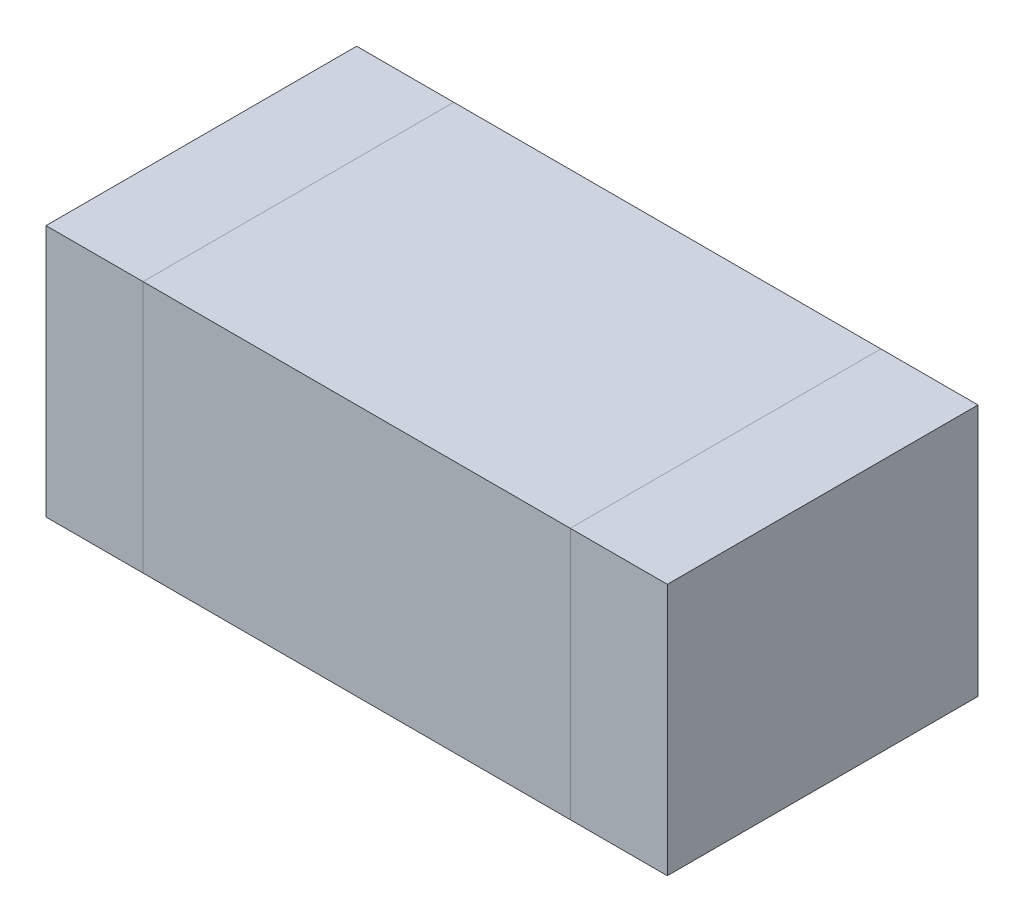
from build123d import *

# Parameters (mm, degrees)
SKETCH1_W                = 3.2
SKETCH1_H                = 1.6
BOSS_EXTRUDE1_DEPTH      = 1.3
SPLIT1_SURFACE_1_1_BACK  = 4.807
SPLIT1_SURFACE_1_1_DEPTH = 9.614
SPLIT1_SURFACE_1_2_BACK  = 4.807
SPLIT1_SURFACE_1_2_DEPTH = 9.614
SPLIT1_SURFACE_2_3_BACK  = 4.807
SPLIT1_SURFACE_2_3_DEPTH = 9.614
SPLIT1_SURFACE_2_4_BACK  = 4.807
SPLIT1_SURFACE_2_4_DEPTH = 9.614


with BuildPart() as part:
    # Sketch1 → Boss-Extrude1 (new body)
    with BuildSketch(Plane(origin=(0, 0, 0), x_dir=(1, 0, 0), z_dir=(0, 1, 0))):
        with Locations((1.6, 0.8)):
            Rectangle(SKETCH1_W, SKETCH1_H)
    extrude(amount=BOSS_EXTRUDE1_DEPTH)


with BuildPart() as body_2:
    # Split1: the piece behind the surface
    add(part.part)
    # Split1 surface 1: a surface, the sketch's curves swept straight by 9.614 mm
    with BuildLine(Plane(origin=(0, 1.3, 0), x_dir=(1, 0, 0), z_dir=(0, 1, 0)).offset(-SPLIT1_SURFACE_1_1_BACK), mode=Mode.PRIVATE) as split1_surface_1_1_path:
        Line((0.5, 1.6), (0.5, 0))
        Line((0.5, 0), (0, 0))
        Line((0, 0), (0, 1.6))
        Line((0, 1.6), (0.5, 1.6))
    split1_surface_1_1 = Shell.extrude(split1_surface_1_1_path.wire(), (0 * SPLIT1_SURFACE_1_1_DEPTH, 1 * SPLIT1_SURFACE_1_1_DEPTH, 0 * SPLIT1_SURFACE_1_1_DEPTH))
    split(bisect_by=split1_surface_1_1, keep=Keep.BOTTOM)


with BuildPart() as part_1:
    add(part.part)

    # Split1: split by a surface, the side it looks to stays
    # Split1 surface 1: a surface, the sketch's curves swept straight by 9.614 mm
    with BuildLine(Plane(origin=(0, 1.3, 0), x_dir=(1, 0, 0), z_dir=(0, 1, 0)).offset(-SPLIT1_SURFACE_1_2_BACK), mode=Mode.PRIVATE) as split1_surface_1_2_path:
        Line((0.5, 1.6), (0.5, 0))
        Line((0.5, 0), (0, 0))
        Line((0, 0), (0, 1.6))
        Line((0, 1.6), (0.5, 1.6))
    split1_surface_1_2 = Shell.extrude(split1_surface_1_2_path.wire(), (0 * SPLIT1_SURFACE_1_2_DEPTH, 1 * SPLIT1_SURFACE_1_2_DEPTH, 0 * SPLIT1_SURFACE_1_2_DEPTH))
    split(bisect_by=split1_surface_1_2, keep=Keep.TOP)


with BuildPart() as body_3:
    # Split1 2: the piece behind the surface
    add(part_1.part)
    # Split1 surface 2: a surface, the sketch's curves swept straight by 9.614 mm
    with BuildLine(Plane(origin=(0, 1.3, 0), x_dir=(1, 0, 0), z_dir=(0, 1, 0)).offset(-SPLIT1_SURFACE_2_3_BACK), mode=Mode.PRIVATE) as split1_surface_2_3_path:
        Line((2.7, 1.6), (2.7, 0))
        Line((2.7, 0), (3.2, 0))
        Line((3.2, 0), (3.2, 1.6))
        Line((3.2, 1.6), (2.7, 1.6))
    split1_surface_2_3 = Shell.extrude(split1_surface_2_3_path.wire(), (0 * SPLIT1_SURFACE_2_3_DEPTH, 1 * SPLIT1_SURFACE_2_3_DEPTH, 0 * SPLIT1_SURFACE_2_3_DEPTH))
    split(bisect_by=split1_surface_2_3, keep=Keep.BOTTOM)


with BuildPart() as part_2:
    add(part_1.part)

    # Split1 2: split by a surface, the side it looks to stays
    # Split1 surface 2: a surface, the sketch's curves swept straight by 9.614 mm
    with BuildLine(Plane(origin=(0, 1.3, 0), x_dir=(1, 0, 0), z_dir=(0, 1, 0)).offset(-SPLIT1_SURFACE_2_4_BACK), mode=Mode.PRIVATE) as split1_surface_2_4_path:
        Line((2.7, 1.6), (2.7, 0))
        Line((2.7, 0), (3.2, 0))
        Line((3.2, 0), (3.2, 1.6))
        Line((3.2, 1.6), (2.7, 1.6))
    split1_surface_2_4 = Shell.extrude(split1_surface_2_4_path.wire(), (0 * SPLIT1_SURFACE_2_4_DEPTH, 1 * SPLIT1_SURFACE_2_4_DEPTH, 0 * SPLIT1_SURFACE_2_4_DEPTH))
    split(bisect_by=split1_surface_2_4, keep=Keep.TOP)


solid = Compound([body_2.part, body_3.part, part_2.part])
